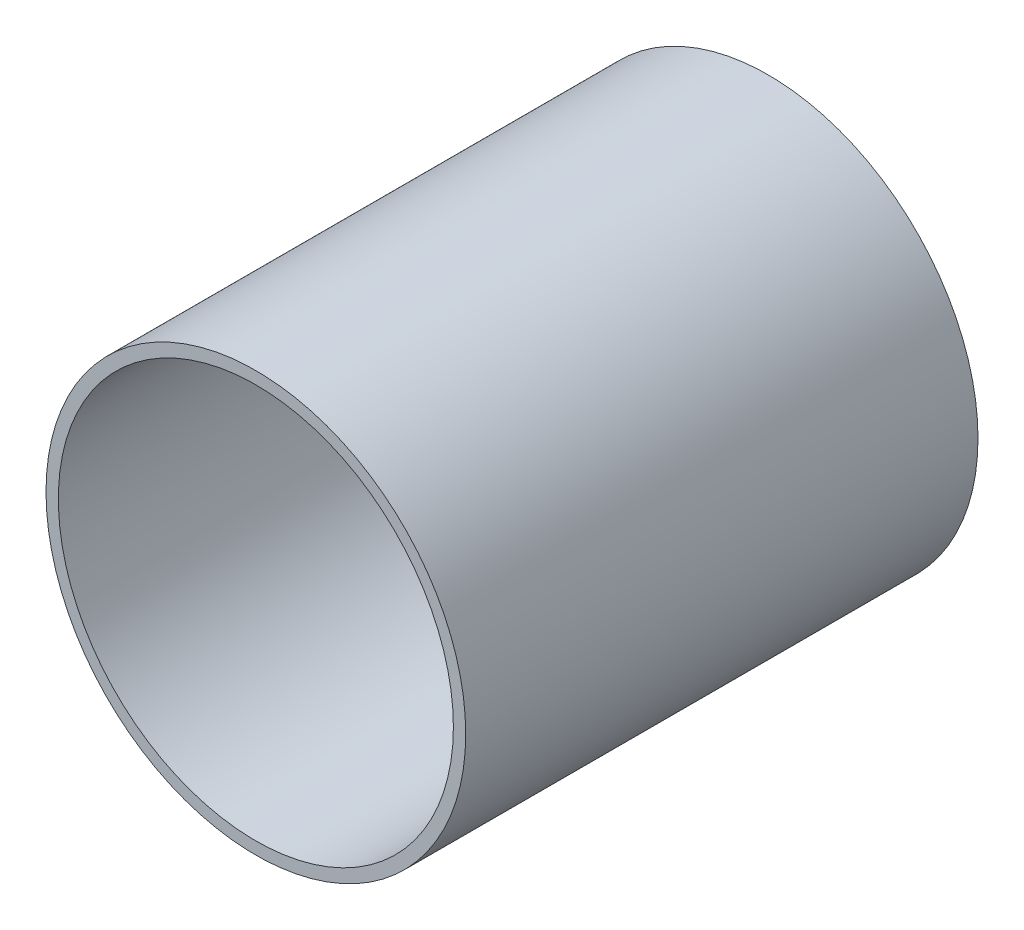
ISO-10303-21;
HEADER;
FILE_DESCRIPTION(('STEP AP214'),'2;1');
FILE_NAME('part.step','',(''),(''),'','','');
FILE_SCHEMA(('AUTOMOTIVE_DESIGN { 1 0 10303 214 1 1 1 1 }'));
ENDSEC;
DATA;
#1=APPLICATION_CONTEXT('core data for automotive mechanical design processes');
#2=APPLICATION_PROTOCOL_DEFINITION('international standard','automotive_design',2000,#1);
#3=PRODUCT_CONTEXT('',#1,'mechanical');
#4=PRODUCT('Part','Part','',(#3));
#5=PRODUCT_RELATED_PRODUCT_CATEGORY('part','',(#4));
#6=PRODUCT_DEFINITION_FORMATION('','',#4);
#7=PRODUCT_DEFINITION_CONTEXT('part definition',#1,'design');
#8=PRODUCT_DEFINITION('design','',#6,#7);
#9=PRODUCT_DEFINITION_SHAPE('','',#8);
#10=(LENGTH_UNIT() NAMED_UNIT(*) SI_UNIT(.MILLI.,.METRE.));
#11=(NAMED_UNIT(*) PLANE_ANGLE_UNIT() SI_UNIT($,.RADIAN.));
#12=(NAMED_UNIT(*) SI_UNIT($,.STERADIAN.) SOLID_ANGLE_UNIT());
#13=UNCERTAINTY_MEASURE_WITH_UNIT(LENGTH_MEASURE(1.E-05),#10,'distance_accuracy_value','');
#14=(GEOMETRIC_REPRESENTATION_CONTEXT(3) GLOBAL_UNCERTAINTY_ASSIGNED_CONTEXT((#13)) GLOBAL_UNIT_ASSIGNED_CONTEXT((#10,
#11,#12)) REPRESENTATION_CONTEXT('',''));
#15=CARTESIAN_POINT('',(0.,0.,0.));
#16=DIRECTION('',(0.,0.,1.));
#17=DIRECTION('',(1.,0.,0.));
#18=AXIS2_PLACEMENT_3D('',#15,#16,#17);
#19=CARTESIAN_POINT('',(0.,0.,127.));
#20=DIRECTION('',(0.,0.,1.));
#21=DIRECTION('',(1.,0.,0.));
#22=AXIS2_PLACEMENT_3D('',#19,#20,#21);
#23=PLANE('',#22);
#24=CARTESIAN_POINT('',(0.,0.,127.));
#25=DIRECTION('',(0.,0.,1.));
#26=DIRECTION('',(1.,0.,0.));
#27=AXIS2_PLACEMENT_3D('',#24,#25,#26);
#28=CIRCLE('',#27,53.975);
#29=CARTESIAN_POINT('',(53.975,0.,127.));
#30=VERTEX_POINT('',#29);
#31=EDGE_CURVE('E10',#30,#30,#28,.T.);
#32=ORIENTED_EDGE('',*,*,#31,.T.);
#33=EDGE_LOOP('',(#32));
#34=FACE_BOUND('',#33,.T.);
#35=CARTESIAN_POINT('',(0.,0.,127.));
#36=DIRECTION('',(0.,0.,1.));
#37=DIRECTION('',(1.,0.,0.));
#38=AXIS2_PLACEMENT_3D('',#35,#36,#37);
#39=CIRCLE('',#38,50.8);
#40=CARTESIAN_POINT('',(50.8,0.,127.));
#41=VERTEX_POINT('',#40);
#42=EDGE_CURVE('E38',#41,#41,#39,.T.);
#43=ORIENTED_EDGE('',*,*,#42,.F.);
#44=EDGE_LOOP('',(#43));
#45=FACE_BOUND('',#44,.T.);
#46=ADVANCED_FACE('F31',(#34,#45),#23,.T.);
#47=CARTESIAN_POINT('',(0.,0.,127.));
#48=DIRECTION('',(0.,0.,-1.));
#49=DIRECTION('',(-1.,0.,0.));
#50=AXIS2_PLACEMENT_3D('',#47,#48,#49);
#51=CYLINDRICAL_SURFACE('',#50,53.975);
#52=ORIENTED_EDGE('',*,*,#31,.F.);
#53=EDGE_LOOP('',(#52));
#54=FACE_BOUND('',#53,.T.);
#55=CARTESIAN_POINT('',(0.,0.,-4.7498));
#56=DIRECTION('',(0.,0.,-1.));
#57=DIRECTION('',(-1.,0.,0.));
#58=AXIS2_PLACEMENT_3D('',#55,#56,#57);
#59=CIRCLE('',#58,53.975);
#60=CARTESIAN_POINT('',(-53.975,0.,-4.7498));
#61=VERTEX_POINT('',#60);
#62=EDGE_CURVE('E47',#61,#61,#59,.T.);
#63=ORIENTED_EDGE('',*,*,#62,.F.);
#64=EDGE_LOOP('',(#63));
#65=FACE_BOUND('',#64,.T.);
#66=ADVANCED_FACE('F33',(#54,#65),#51,.T.);
#67=CARTESIAN_POINT('',(0.,0.,127.));
#68=DIRECTION('',(0.,0.,-1.));
#69=DIRECTION('',(-1.,0.,0.));
#70=AXIS2_PLACEMENT_3D('',#67,#68,#69);
#71=CYLINDRICAL_SURFACE('',#70,50.8);
#72=ORIENTED_EDGE('',*,*,#42,.T.);
#73=EDGE_LOOP('',(#72));
#74=FACE_BOUND('',#73,.T.);
#75=CARTESIAN_POINT('',(0.,0.,0.));
#76=DIRECTION('',(0.,0.,1.));
#77=DIRECTION('',(1.,0.,0.));
#78=AXIS2_PLACEMENT_3D('',#75,#76,#77);
#79=CIRCLE('',#78,50.8);
#80=CARTESIAN_POINT('',(50.8,0.,0.));
#81=VERTEX_POINT('',#80);
#82=EDGE_CURVE('E42',#81,#81,#79,.T.);
#83=ORIENTED_EDGE('',*,*,#82,.F.);
#84=EDGE_LOOP('',(#83));
#85=FACE_BOUND('',#84,.T.);
#86=ADVANCED_FACE('F55',(#74,#85),#71,.F.);
#87=CARTESIAN_POINT('',(0.,0.,0.));
#88=DIRECTION('',(0.,0.,-1.));
#89=DIRECTION('',(-1.,0.,0.));
#90=AXIS2_PLACEMENT_3D('',#87,#88,#89);
#91=PLANE('',#90);
#92=ORIENTED_EDGE('',*,*,#82,.T.);
#93=EDGE_LOOP('',(#92));
#94=FACE_BOUND('',#93,.T.);
#95=ADVANCED_FACE('F61',(#94),#91,.F.);
#96=CARTESIAN_POINT('',(0.,0.,-4.7498));
#97=DIRECTION('',(0.,0.,-1.));
#98=DIRECTION('',(-1.,0.,0.));
#99=AXIS2_PLACEMENT_3D('',#96,#97,#98);
#100=PLANE('',#99);
#101=ORIENTED_EDGE('',*,*,#62,.T.);
#102=EDGE_LOOP('',(#101));
#103=FACE_BOUND('',#102,.T.);
#104=ADVANCED_FACE('F52',(#103),#100,.T.);
#105=CLOSED_SHELL('',(#46,#66,#86,#95,#104));
#106=MANIFOLD_SOLID_BREP('B2',#105);
#107=ADVANCED_BREP_SHAPE_REPRESENTATION('',(#18,#106),#14);
#108=SHAPE_DEFINITION_REPRESENTATION(#9,#107);
ENDSEC;
END-ISO-10303-21;
